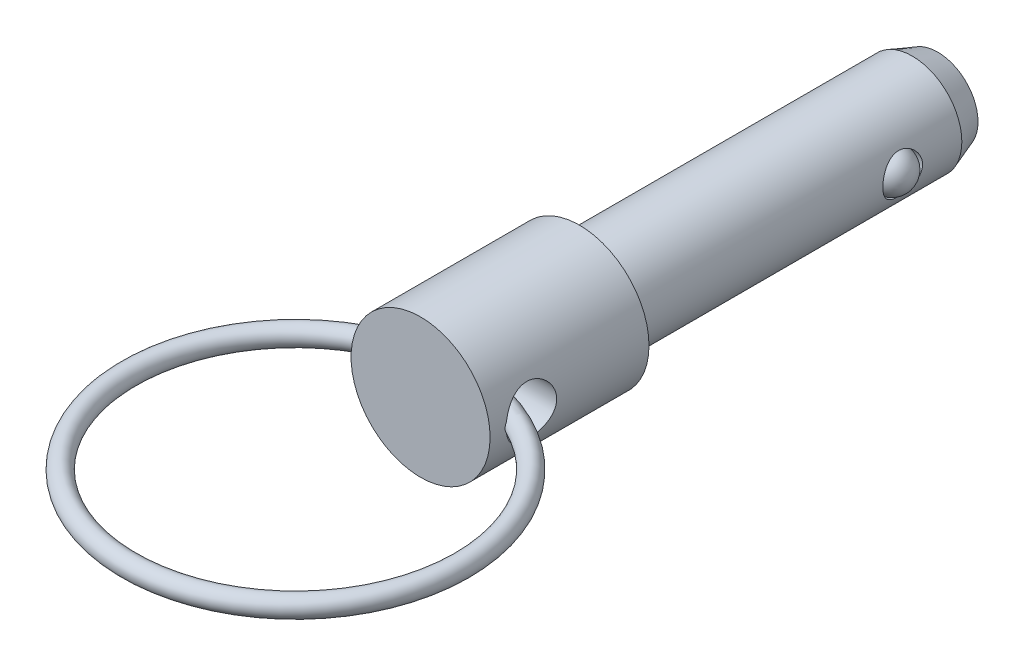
ISO-10303-21;
HEADER;
FILE_DESCRIPTION(('STEP AP214'),'2;1');
FILE_NAME('part.step','',(''),(''),'','','');
FILE_SCHEMA(('AUTOMOTIVE_DESIGN { 1 0 10303 214 1 1 1 1 }'));
ENDSEC;
DATA;
#1=APPLICATION_CONTEXT('core data for automotive mechanical design processes');
#2=APPLICATION_PROTOCOL_DEFINITION('international standard','automotive_design',2000,#1);
#3=PRODUCT_CONTEXT('',#1,'mechanical');
#4=PRODUCT('Part','Part','',(#3));
#5=PRODUCT_RELATED_PRODUCT_CATEGORY('part','',(#4));
#6=PRODUCT_DEFINITION_FORMATION('','',#4);
#7=PRODUCT_DEFINITION_CONTEXT('part definition',#1,'design');
#8=PRODUCT_DEFINITION('design','',#6,#7);
#9=PRODUCT_DEFINITION_SHAPE('','',#8);
#10=(LENGTH_UNIT() NAMED_UNIT(*) SI_UNIT(.MILLI.,.METRE.));
#11=(NAMED_UNIT(*) PLANE_ANGLE_UNIT() SI_UNIT($,.RADIAN.));
#12=(NAMED_UNIT(*) SI_UNIT($,.STERADIAN.) SOLID_ANGLE_UNIT());
#13=UNCERTAINTY_MEASURE_WITH_UNIT(LENGTH_MEASURE(1.E-05),#10,'distance_accuracy_value','');
#14=(GEOMETRIC_REPRESENTATION_CONTEXT(3) GLOBAL_UNCERTAINTY_ASSIGNED_CONTEXT((#13)) GLOBAL_UNIT_ASSIGNED_CONTEXT((#10,
#11,#12)) REPRESENTATION_CONTEXT('',''));
#15=CARTESIAN_POINT('',(0.,0.,0.));
#16=DIRECTION('',(0.,0.,1.));
#17=DIRECTION('',(1.,0.,0.));
#18=AXIS2_PLACEMENT_3D('',#15,#16,#17);
#19=CARTESIAN_POINT('',(7.9375,0.,9.398));
#20=DIRECTION('',(-1.,0.,0.));
#21=DIRECTION('',(0.,0.,-1.));
#22=AXIS2_PLACEMENT_3D('',#19,#20,#21);
#23=CYLINDRICAL_SURFACE('',#22,2.0193);
#24=CARTESIAN_POINT('',(-5.55645,0.413388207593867,11.3745329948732));
#25=CARTESIAN_POINT('',(-5.53323669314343,0.388835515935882,11.3796705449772));
#26=CARTESIAN_POINT('',(-5.51157389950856,0.362641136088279,11.3846690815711));
#27=CARTESIAN_POINT('',(-5.47216390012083,0.307044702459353,11.3940198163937));
#28=CARTESIAN_POINT('',(-5.45444977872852,0.277618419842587,11.3983664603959));
#29=CARTESIAN_POINT('',(-5.42406600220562,0.215851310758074,11.4059720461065));
#30=CARTESIAN_POINT('',(-5.41142802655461,0.183493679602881,11.4092241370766));
#31=CARTESIAN_POINT('',(-5.39235124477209,0.116986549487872,11.4141821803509));
#32=CARTESIAN_POINT('',(-5.38588919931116,0.082844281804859,11.4158939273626));
#33=CARTESIAN_POINT('',(-5.37995615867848,0.0172985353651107,11.4174656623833));
#34=CARTESIAN_POINT('',(-5.37986165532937,-0.0140451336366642,11.4174908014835));
#35=CARTESIAN_POINT('',(-5.38511249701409,-0.0762532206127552,11.4160995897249));
#36=CARTESIAN_POINT('',(-5.39046041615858,-0.10711740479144,11.4146825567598));
#37=CARTESIAN_POINT('',(-5.40574321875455,-0.165640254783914,11.4106965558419));
#38=CARTESIAN_POINT('',(-5.41539031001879,-0.193380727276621,11.408200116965));
#39=CARTESIAN_POINT('',(-5.43862859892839,-0.247073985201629,11.4023097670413));
#40=CARTESIAN_POINT('',(-5.45222392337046,-0.273024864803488,11.398914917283));
#41=CARTESIAN_POINT('',(-5.48024922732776,-0.318737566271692,11.3920973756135));
#42=CARTESIAN_POINT('',(-5.49418727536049,-0.338820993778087,11.3887682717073));
#43=CARTESIAN_POINT('',(-5.52397071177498,-0.377330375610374,11.3818282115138));
#44=CARTESIAN_POINT('',(-5.53980753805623,-0.395763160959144,11.378218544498));
#45=CARTESIAN_POINT('',(-5.55645,-0.413388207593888,11.3745329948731));
#46=B_SPLINE_CURVE_WITH_KNOTS('',3,(#24,#25,#26,#27,#28,#29,#30,#31,#32,#33,#34,#35,#36,#37,#38,
#39,#40,#41,#42,#43,#44,#45),.UNSPECIFIED.,.F.,.F.,(4,2,2,2,2,2,2,2,2,2,4),(0.,
0.102621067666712,0.206072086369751,0.310159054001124,0.413852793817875,0.507376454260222,
0.600944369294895,0.689017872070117,0.77718376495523,0.851068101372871,0.924630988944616),.UNSPECIFIED.);
#47=CARTESIAN_POINT('',(-5.54200209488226,0.397651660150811,11.3777589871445));
#48=VERTEX_POINT('',#47);
#49=CARTESIAN_POINT('',(-5.54200209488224,-0.397651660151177,11.3777589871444));
#50=VERTEX_POINT('',#49);
#51=EDGE_CURVE('E39',#48,#50,#46,.T.);
#52=ORIENTED_EDGE('',*,*,#51,.F.);
#53=CARTESIAN_POINT('',(-5.55625,0.,11.4173));
#54=CARTESIAN_POINT('',(-5.55624527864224,-0.10943212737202,11.4172937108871));
#55=CARTESIAN_POINT('',(-5.55298237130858,-0.218969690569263,11.408361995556));
#56=CARTESIAN_POINT('',(-5.54026368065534,-0.434902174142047,11.372953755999));
#57=CARTESIAN_POINT('',(-5.53079819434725,-0.541291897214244,11.3464497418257));
#58=CARTESIAN_POINT('',(-5.50670156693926,-0.747605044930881,11.2769560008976));
#59=CARTESIAN_POINT('',(-5.49208344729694,-0.847544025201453,11.2340078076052));
#60=CARTESIAN_POINT('',(-5.45915039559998,-1.03875753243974,11.1330083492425));
#61=CARTESIAN_POINT('',(-5.44083572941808,-1.13003268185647,11.0749581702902));
#62=CARTESIAN_POINT('',(-5.4015811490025,-1.30505728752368,10.9429422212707));
#63=CARTESIAN_POINT('',(-5.38056990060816,-1.38841141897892,10.8684736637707));
#64=CARTESIAN_POINT('',(-5.33865236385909,-1.54176439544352,10.7067995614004));
#65=CARTESIAN_POINT('',(-5.31774611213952,-1.61175885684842,10.6195898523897));
#66=CARTESIAN_POINT('',(-5.27759352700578,-1.73882919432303,10.4311528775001));
#67=CARTESIAN_POINT('',(-5.25843183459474,-1.79536185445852,10.3295394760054));
#68=CARTESIAN_POINT('',(-5.22503611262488,-1.89036141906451,10.1174402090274));
#69=CARTESIAN_POINT('',(-5.21080023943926,-1.92883508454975,10.0069576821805));
#70=CARTESIAN_POINT('',(-5.18962447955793,-1.985091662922,9.78477737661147));
#71=CARTESIAN_POINT('',(-5.18242178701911,-2.00362275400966,9.67329490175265));
#72=CARTESIAN_POINT('',(-5.17535625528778,-2.02180769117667,9.44858805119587));
#73=CARTESIAN_POINT('',(-5.17549061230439,-2.02146874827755,9.33536435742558));
#74=CARTESIAN_POINT('',(-5.18285629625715,-2.00249790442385,9.11709454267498));
#75=CARTESIAN_POINT('',(-5.18969215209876,-1.98488533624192,9.01194405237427));
#76=CARTESIAN_POINT('',(-5.20903632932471,-1.93354575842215,8.80620743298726));
#77=CARTESIAN_POINT('',(-5.22154547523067,-1.89981640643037,8.70562196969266));
#78=CARTESIAN_POINT('',(-5.25107746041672,-1.81661001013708,8.50972358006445));
#79=CARTESIAN_POINT('',(-5.26817827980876,-1.76685762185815,8.41453987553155));
#80=CARTESIAN_POINT('',(-5.30493780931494,-1.65321144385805,8.23357336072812));
#81=CARTESIAN_POINT('',(-5.32459724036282,-1.58931366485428,8.14779321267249));
#82=CARTESIAN_POINT('',(-5.36576425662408,-1.44447059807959,7.98240722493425));
#83=CARTESIAN_POINT('',(-5.3873104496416,-1.36270785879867,7.90352531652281));
#84=CARTESIAN_POINT('',(-5.42876622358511,-1.18682967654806,7.76035905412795));
#85=CARTESIAN_POINT('',(-5.44867505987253,-1.09270866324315,7.69608131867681));
#86=CARTESIAN_POINT('',(-5.48497084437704,-0.893001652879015,7.58320896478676));
#87=CARTESIAN_POINT('',(-5.50130295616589,-0.787270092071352,7.53485348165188));
#88=CARTESIAN_POINT('',(-5.52817729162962,-0.568540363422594,7.45692936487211));
#89=CARTESIAN_POINT('',(-5.53873126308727,-0.455557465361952,7.42732259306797));
#90=CARTESIAN_POINT('',(-5.54924569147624,-0.284581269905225,7.39803699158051));
#91=CARTESIAN_POINT('',(-5.5518636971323,-0.227949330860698,7.39079572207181));
#92=CARTESIAN_POINT('',(-5.55536708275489,-0.114221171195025,7.38112558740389));
#93=CARTESIAN_POINT('',(-5.55625246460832,-0.0571249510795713,7.37869671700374));
#94=CARTESIAN_POINT('',(-5.55624527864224,0.109432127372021,7.37870628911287));
#95=CARTESIAN_POINT('',(-5.55298237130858,0.218969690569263,7.38763800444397));
#96=CARTESIAN_POINT('',(-5.54026368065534,0.434902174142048,7.42304624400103));
#97=CARTESIAN_POINT('',(-5.53079819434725,0.541291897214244,7.44955025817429));
#98=CARTESIAN_POINT('',(-5.50670156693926,0.747605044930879,7.51904399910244));
#99=CARTESIAN_POINT('',(-5.49208344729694,0.847544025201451,7.56199219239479));
#100=CARTESIAN_POINT('',(-5.45915039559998,1.03875753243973,7.66299165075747));
#101=CARTESIAN_POINT('',(-5.44083572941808,1.13003268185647,7.72104182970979));
#102=CARTESIAN_POINT('',(-5.4015811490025,1.30505728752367,7.85305777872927));
#103=CARTESIAN_POINT('',(-5.38056990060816,1.38841141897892,7.92752633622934));
#104=CARTESIAN_POINT('',(-5.33865236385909,1.54176439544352,8.08920043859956));
#105=CARTESIAN_POINT('',(-5.31774611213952,1.61175885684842,8.17641014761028));
#106=CARTESIAN_POINT('',(-5.27759352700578,1.73882919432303,8.36484712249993));
#107=CARTESIAN_POINT('',(-5.25843183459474,1.79536185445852,8.46646052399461));
#108=CARTESIAN_POINT('',(-5.22503611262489,1.89036141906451,8.6785597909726));
#109=CARTESIAN_POINT('',(-5.21080023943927,1.92883508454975,8.7890423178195));
#110=CARTESIAN_POINT('',(-5.18962447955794,1.98509166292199,9.01122262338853));
#111=CARTESIAN_POINT('',(-5.18242178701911,2.00362275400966,9.12270509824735));
#112=CARTESIAN_POINT('',(-5.17535625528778,2.02180769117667,9.34741194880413));
#113=CARTESIAN_POINT('',(-5.17549061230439,2.02146874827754,9.46063564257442));
#114=CARTESIAN_POINT('',(-5.18285629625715,2.00249790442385,9.67890545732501));
#115=CARTESIAN_POINT('',(-5.18969215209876,1.98488533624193,9.78405594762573));
#116=CARTESIAN_POINT('',(-5.20903632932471,1.93354575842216,9.98979256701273));
#117=CARTESIAN_POINT('',(-5.22154547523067,1.89981640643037,10.0903780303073));
#118=CARTESIAN_POINT('',(-5.25107746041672,1.81661001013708,10.2862764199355));
#119=CARTESIAN_POINT('',(-5.26817827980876,1.76685762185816,10.3814601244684));
#120=CARTESIAN_POINT('',(-5.30493780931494,1.65321144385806,10.5624266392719));
#121=CARTESIAN_POINT('',(-5.32459724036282,1.58931366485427,10.6482067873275));
#122=CARTESIAN_POINT('',(-5.36576425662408,1.44447059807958,10.8135927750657));
#123=CARTESIAN_POINT('',(-5.3873104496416,1.36270785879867,10.8924746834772));
#124=CARTESIAN_POINT('',(-5.42876622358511,1.18682967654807,11.035640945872));
#125=CARTESIAN_POINT('',(-5.44867505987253,1.09270866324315,11.0999186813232));
#126=CARTESIAN_POINT('',(-5.48497084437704,0.893001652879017,11.2127910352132));
#127=CARTESIAN_POINT('',(-5.50130295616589,0.787270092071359,11.2611465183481));
#128=CARTESIAN_POINT('',(-5.52817729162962,0.568540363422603,11.3390706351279));
#129=CARTESIAN_POINT('',(-5.53873126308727,0.455557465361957,11.368677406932));
#130=CARTESIAN_POINT('',(-5.54924569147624,0.284581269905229,11.3979630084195));
#131=CARTESIAN_POINT('',(-5.5518636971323,0.227949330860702,11.4052042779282));
#132=CARTESIAN_POINT('',(-5.55536708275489,0.114221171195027,11.4148744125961));
#133=CARTESIAN_POINT('',(-5.55625246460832,0.0571249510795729,11.4173032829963));
#134=CARTESIAN_POINT('',(-5.55625,0.,11.4173));
#135=B_SPLINE_CURVE_WITH_KNOTS('',3,(#53,#54,#55,#56,#57,#58,#59,#60,#61,#62,#63,#64,#65,#66,
#67,#68,#69,#70,#71,#72,#73,#74,#75,#76,#77,#78,#79,#80,#81,#82,#83,#84,#85,#86,#87,#88,#89,#90,
#91,#92,#93,#94,#95,#96,#97,#98,#99,#100,#101,#102,#103,#104,#105,#106,#107,#108,#109,#110,#111,
#112,#113,#114,#115,#116,#117,#118,#119,#120,#121,#122,#123,#124,#125,#126,#127,#128,#129,#130,
#131,#132,#133,#134),.UNSPECIFIED.,.T.,.F.,(4,2,2,2,2,2,2,2,2,2,2,2,2,2,2,2,2,2,2,2,2,2,2,2,2,2,
2,2,2,2,2,2,2,2,2,2,2,2,2,2,4),(0.,0.328075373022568,0.656665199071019,0.984430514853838,
1.31217226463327,1.65185430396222,1.99164760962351,2.34343505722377,2.6950906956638,
3.03303658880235,3.37085333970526,3.68986542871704,4.0089238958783,4.33378721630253,
4.65874227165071,5.00406386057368,5.34954163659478,5.69999369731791,6.04973056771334,
6.22099023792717,6.39224972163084,6.72032509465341,7.04891492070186,7.37668023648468,
7.7044219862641,8.04410402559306,8.38389733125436,8.73568477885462,9.08734041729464,
9.42528631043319,9.7631030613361,10.0821151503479,10.4011736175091,10.7260369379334,
11.0509919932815,11.3963135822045,11.7417913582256,12.0922434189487,12.4419802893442,
12.613239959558,12.7844994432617),.UNSPECIFIED.);
#136=EDGE_CURVE('E65',#50,#48,#135,.T.);
#137=ORIENTED_EDGE('',*,*,#136,.F.);
#138=EDGE_LOOP('',(#52,#137));
#139=FACE_BOUND('',#138,.T.);
#140=CARTESIAN_POINT('',(5.55645,-0.413388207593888,11.3745329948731));
#141=CARTESIAN_POINT('',(5.53323669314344,-0.388835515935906,11.3796705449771));
#142=CARTESIAN_POINT('',(5.51157389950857,-0.362641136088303,11.3846690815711));
#143=CARTESIAN_POINT('',(5.47216390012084,-0.307044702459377,11.3940198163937));
#144=CARTESIAN_POINT('',(5.45444977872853,-0.277618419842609,11.3983664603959));
#145=CARTESIAN_POINT('',(5.42406600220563,-0.215851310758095,11.4059720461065));
#146=CARTESIAN_POINT('',(5.41142802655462,-0.183493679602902,11.4092241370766));
#147=CARTESIAN_POINT('',(5.39235124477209,-0.116986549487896,11.4141821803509));
#148=CARTESIAN_POINT('',(5.38588919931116,-0.0828442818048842,11.4158939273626));
#149=CARTESIAN_POINT('',(5.37995615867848,-0.0172985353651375,11.4174656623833));
#150=CARTESIAN_POINT('',(5.37986165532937,0.0140451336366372,11.4174908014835));
#151=CARTESIAN_POINT('',(5.3851124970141,0.0762532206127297,11.4160995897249));
#152=CARTESIAN_POINT('',(5.39046041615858,0.107117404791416,11.4146825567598));
#153=CARTESIAN_POINT('',(5.40574321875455,0.165640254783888,11.4106965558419));
#154=CARTESIAN_POINT('',(5.41539031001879,0.19338072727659,11.408200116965));
#155=CARTESIAN_POINT('',(5.43862859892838,0.247073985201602,11.4023097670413));
#156=CARTESIAN_POINT('',(5.45222392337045,0.273024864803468,11.398914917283));
#157=CARTESIAN_POINT('',(5.48024922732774,0.318737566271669,11.3920973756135));
#158=CARTESIAN_POINT('',(5.49418727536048,0.338820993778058,11.3887682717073));
#159=CARTESIAN_POINT('',(5.52397071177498,0.37733037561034,11.3818282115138));
#160=CARTESIAN_POINT('',(5.53980753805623,0.395763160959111,11.378218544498));
#161=CARTESIAN_POINT('',(5.55645,0.413388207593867,11.3745329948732));
#162=B_SPLINE_CURVE_WITH_KNOTS('',3,(#140,#141,#142,#143,#144,#145,#146,#147,#148,#149,#150,
#151,#152,#153,#154,#155,#156,#157,#158,#159,#160,#161),.UNSPECIFIED.,.F.,.F.,(4,2,2,2,2,2,2,2,
2,2,4),(0.,0.102621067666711,0.206072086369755,0.310159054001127,0.413852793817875,
0.507376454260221,0.600944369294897,0.689017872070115,0.777183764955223,0.851068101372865,
0.924630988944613),.UNSPECIFIED.);
#163=CARTESIAN_POINT('',(5.54200209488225,-0.397651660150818,11.3777589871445));
#164=VERTEX_POINT('',#163);
#165=CARTESIAN_POINT('',(5.54200209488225,0.397651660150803,11.3777589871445));
#166=VERTEX_POINT('',#165);
#167=EDGE_CURVE('E32',#164,#166,#162,.T.);
#168=ORIENTED_EDGE('',*,*,#167,.F.);
#169=CARTESIAN_POINT('',(5.55625,0.,7.3787));
#170=CARTESIAN_POINT('',(5.55624527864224,-0.109432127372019,7.37870628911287));
#171=CARTESIAN_POINT('',(5.55298237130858,-0.218969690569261,7.38763800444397));
#172=CARTESIAN_POINT('',(5.54026368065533,-0.434902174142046,7.42304624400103));
#173=CARTESIAN_POINT('',(5.53079819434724,-0.541291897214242,7.44955025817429));
#174=CARTESIAN_POINT('',(5.50670156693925,-0.747605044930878,7.51904399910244));
#175=CARTESIAN_POINT('',(5.49208344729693,-0.84754402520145,7.56199219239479));
#176=CARTESIAN_POINT('',(5.45915039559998,-1.03875753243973,7.66299165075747));
#177=CARTESIAN_POINT('',(5.44083572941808,-1.13003268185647,7.72104182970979));
#178=CARTESIAN_POINT('',(5.4015811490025,-1.30505728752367,7.85305777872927));
#179=CARTESIAN_POINT('',(5.38056990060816,-1.38841141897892,7.92752633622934));
#180=CARTESIAN_POINT('',(5.33865236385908,-1.54176439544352,8.08920043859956));
#181=CARTESIAN_POINT('',(5.31774611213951,-1.61175885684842,8.17641014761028));
#182=CARTESIAN_POINT('',(5.27759352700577,-1.73882919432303,8.36484712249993));
#183=CARTESIAN_POINT('',(5.25843183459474,-1.79536185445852,8.46646052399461));
#184=CARTESIAN_POINT('',(5.22503611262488,-1.89036141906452,8.67855979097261));
#185=CARTESIAN_POINT('',(5.21080023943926,-1.92883508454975,8.7890423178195));
#186=CARTESIAN_POINT('',(5.18962447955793,-1.985091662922,9.01122262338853));
#187=CARTESIAN_POINT('',(5.18242178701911,-2.00362275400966,9.12270509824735));
#188=CARTESIAN_POINT('',(5.17535625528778,-2.02180769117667,9.34741194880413));
#189=CARTESIAN_POINT('',(5.17549061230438,-2.02146874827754,9.46063564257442));
#190=CARTESIAN_POINT('',(5.18285629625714,-2.00249790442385,9.67890545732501));
#191=CARTESIAN_POINT('',(5.18969215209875,-1.98488533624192,9.78405594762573));
#192=CARTESIAN_POINT('',(5.20903632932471,-1.93354575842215,9.98979256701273));
#193=CARTESIAN_POINT('',(5.22154547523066,-1.89981640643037,10.0903780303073));
#194=CARTESIAN_POINT('',(5.25107746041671,-1.81661001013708,10.2862764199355));
#195=CARTESIAN_POINT('',(5.26817827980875,-1.76685762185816,10.3814601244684));
#196=CARTESIAN_POINT('',(5.30493780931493,-1.65321144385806,10.5624266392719));
#197=CARTESIAN_POINT('',(5.32459724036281,-1.58931366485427,10.6482067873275));
#198=CARTESIAN_POINT('',(5.36576425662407,-1.44447059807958,10.8135927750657));
#199=CARTESIAN_POINT('',(5.3873104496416,-1.36270785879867,10.8924746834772));
#200=CARTESIAN_POINT('',(5.42876622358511,-1.18682967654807,11.035640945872));
#201=CARTESIAN_POINT('',(5.44867505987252,-1.09270866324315,11.0999186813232));
#202=CARTESIAN_POINT('',(5.48497084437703,-0.893001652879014,11.2127910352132));
#203=CARTESIAN_POINT('',(5.50130295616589,-0.787270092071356,11.2611465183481));
#204=CARTESIAN_POINT('',(5.52817729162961,-0.5685403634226,11.3390706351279));
#205=CARTESIAN_POINT('',(5.53873126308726,-0.455557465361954,11.368677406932));
#206=CARTESIAN_POINT('',(5.54924569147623,-0.284581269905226,11.3979630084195));
#207=CARTESIAN_POINT('',(5.5518636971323,-0.227949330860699,11.4052042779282));
#208=CARTESIAN_POINT('',(5.55536708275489,-0.114221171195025,11.4148744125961));
#209=CARTESIAN_POINT('',(5.55625246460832,-0.0571249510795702,11.4173032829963));
#210=CARTESIAN_POINT('',(5.55624527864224,0.109432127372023,11.4172937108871));
#211=CARTESIAN_POINT('',(5.55298237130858,0.218969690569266,11.408361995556));
#212=CARTESIAN_POINT('',(5.54026368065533,0.43490217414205,11.372953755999));
#213=CARTESIAN_POINT('',(5.53079819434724,0.541291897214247,11.3464497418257));
#214=CARTESIAN_POINT('',(5.50670156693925,0.747605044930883,11.2769560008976));
#215=CARTESIAN_POINT('',(5.49208344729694,0.847544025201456,11.2340078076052));
#216=CARTESIAN_POINT('',(5.45915039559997,1.03875753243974,11.1330083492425));
#217=CARTESIAN_POINT('',(5.44083572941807,1.13003268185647,11.0749581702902));
#218=CARTESIAN_POINT('',(5.40158114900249,1.30505728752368,10.9429422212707));
#219=CARTESIAN_POINT('',(5.38056990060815,1.38841141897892,10.8684736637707));
#220=CARTESIAN_POINT('',(5.33865236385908,1.54176439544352,10.7067995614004));
#221=CARTESIAN_POINT('',(5.31774611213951,1.61175885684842,10.6195898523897));
#222=CARTESIAN_POINT('',(5.27759352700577,1.73882919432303,10.4311528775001));
#223=CARTESIAN_POINT('',(5.25843183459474,1.79536185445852,10.3295394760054));
#224=CARTESIAN_POINT('',(5.22503611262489,1.89036141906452,10.1174402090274));
#225=CARTESIAN_POINT('',(5.21080023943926,1.92883508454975,10.0069576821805));
#226=CARTESIAN_POINT('',(5.18962447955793,1.985091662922,9.78477737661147));
#227=CARTESIAN_POINT('',(5.18242178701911,2.00362275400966,9.67329490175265));
#228=CARTESIAN_POINT('',(5.17535625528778,2.02180769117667,9.44858805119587));
#229=CARTESIAN_POINT('',(5.17549061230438,2.02146874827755,9.33536435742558));
#230=CARTESIAN_POINT('',(5.18285629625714,2.00249790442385,9.11709454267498));
#231=CARTESIAN_POINT('',(5.18969215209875,1.98488533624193,9.01194405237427));
#232=CARTESIAN_POINT('',(5.20903632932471,1.93354575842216,8.80620743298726));
#233=CARTESIAN_POINT('',(5.22154547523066,1.89981640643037,8.70562196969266));
#234=CARTESIAN_POINT('',(5.25107746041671,1.81661001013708,8.50972358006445));
#235=CARTESIAN_POINT('',(5.26817827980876,1.76685762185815,8.41453987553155));
#236=CARTESIAN_POINT('',(5.30493780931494,1.65321144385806,8.23357336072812));
#237=CARTESIAN_POINT('',(5.32459724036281,1.58931366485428,8.14779321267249));
#238=CARTESIAN_POINT('',(5.36576425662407,1.44447059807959,7.98240722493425));
#239=CARTESIAN_POINT('',(5.3873104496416,1.36270785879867,7.90352531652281));
#240=CARTESIAN_POINT('',(5.42876622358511,1.18682967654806,7.76035905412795));
#241=CARTESIAN_POINT('',(5.44867505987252,1.09270866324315,7.69608131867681));
#242=CARTESIAN_POINT('',(5.48497084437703,0.893001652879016,7.58320896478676));
#243=CARTESIAN_POINT('',(5.50130295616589,0.787270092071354,7.53485348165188));
#244=CARTESIAN_POINT('',(5.52817729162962,0.568540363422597,7.45692936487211));
#245=CARTESIAN_POINT('',(5.53873126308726,0.455557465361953,7.42732259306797));
#246=CARTESIAN_POINT('',(5.54924569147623,0.284581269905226,7.39803699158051));
#247=CARTESIAN_POINT('',(5.5518636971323,0.227949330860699,7.39079572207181));
#248=CARTESIAN_POINT('',(5.55536708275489,0.114221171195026,7.38112558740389));
#249=CARTESIAN_POINT('',(5.55625246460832,0.0571249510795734,7.37869671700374));
#250=CARTESIAN_POINT('',(5.55625,0.,7.3787));
#251=B_SPLINE_CURVE_WITH_KNOTS('',3,(#169,#170,#171,#172,#173,#174,#175,#176,#177,#178,#179,
#180,#181,#182,#183,#184,#185,#186,#187,#188,#189,#190,#191,#192,#193,#194,#195,#196,#197,#198,
#199,#200,#201,#202,#203,#204,#205,#206,#207,#208,#209,#210,#211,#212,#213,#214,#215,#216,#217,
#218,#219,#220,#221,#222,#223,#224,#225,#226,#227,#228,#229,#230,#231,#232,#233,#234,#235,#236,
#237,#238,#239,#240,#241,#242,#243,#244,#245,#246,#247,#248,#249,#250),.UNSPECIFIED.,.T.,.F.,(4,
2,2,2,2,2,2,2,2,2,2,2,2,2,2,2,2,2,2,2,2,2,2,2,2,2,2,2,2,2,2,2,2,2,2,2,2,2,2,2,4),(0.,
0.328075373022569,0.65666519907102,0.984430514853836,1.31217226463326,1.65185430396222,
1.99164760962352,2.34343505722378,2.6950906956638,3.03303658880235,3.37085333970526,
3.68986542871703,4.00892389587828,4.33378721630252,4.65874227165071,5.00406386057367,
5.34954163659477,5.6999936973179,6.04973056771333,6.22099023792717,6.39224972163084,
6.72032509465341,7.04891492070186,7.37668023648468,7.7044219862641,8.04410402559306,
8.38389733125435,8.73568477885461,9.08734041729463,9.42528631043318,9.7631030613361,
10.0821151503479,10.4011736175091,10.7260369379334,11.0509919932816,11.3963135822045,
11.7417913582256,12.0922434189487,12.4419802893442,12.613239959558,12.7844994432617),.UNSPECIFIED.);
#252=EDGE_CURVE('E61',#166,#164,#251,.T.);
#253=ORIENTED_EDGE('',*,*,#252,.F.);
#254=EDGE_LOOP('',(#168,#253));
#255=FACE_BOUND('',#254,.T.);
#256=ADVANCED_FACE('F14',(#139,#255),#23,.F.);
#257=CARTESIAN_POINT('',(0.,0.,-28.63596));
#258=DIRECTION('',(0.,0.,-1.));
#259=DIRECTION('',(1.,0.,0.));
#260=AXIS2_PLACEMENT_3D('',#257,#258,#259);
#261=CYLINDRICAL_SURFACE('',#260,5.55625);
#262=ORIENTED_EDGE('',*,*,#252,.T.);
#263=CARTESIAN_POINT('',(5.55009347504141,-0.261488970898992,9.7860840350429));
#264=CARTESIAN_POINT('',(5.54812529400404,-0.303251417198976,9.80096224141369));
#265=CARTESIAN_POINT('',(5.5457404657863,-0.34375863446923,9.8194200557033));
#266=CARTESIAN_POINT('',(5.54040847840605,-0.421066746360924,9.86292845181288));
#267=CARTESIAN_POINT('',(5.5374605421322,-0.45786241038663,9.88798816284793));
#268=CARTESIAN_POINT('',(5.53134134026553,-0.526658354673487,9.94386457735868));
#269=CARTESIAN_POINT('',(5.52817046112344,-0.558666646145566,9.97467146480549));
#270=CARTESIAN_POINT('',(5.52194469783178,-0.617178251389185,10.0411137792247));
#271=CARTESIAN_POINT('',(5.51888978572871,-0.643682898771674,10.0767480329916));
#272=CARTESIAN_POINT('',(5.51313628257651,-0.69125437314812,10.1527268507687));
#273=CARTESIAN_POINT('',(5.51044827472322,-0.71217180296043,10.1931655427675));
#274=CARTESIAN_POINT('',(5.50578097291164,-0.747399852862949,10.2768577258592));
#275=CARTESIAN_POINT('',(5.50380188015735,-0.761708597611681,10.3201120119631));
#276=CARTESIAN_POINT('',(5.50062483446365,-0.784334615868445,10.4110491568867));
#277=CARTESIAN_POINT('',(5.4994831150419,-0.792223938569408,10.4588401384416));
#278=CARTESIAN_POINT('',(5.49826873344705,-0.800607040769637,10.5550754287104));
#279=CARTESIAN_POINT('',(5.49819646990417,-0.801098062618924,10.6035199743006));
#280=CARTESIAN_POINT('',(5.49912806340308,-0.79468062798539,10.7039443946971));
#281=CARTESIAN_POINT('',(5.50022168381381,-0.787154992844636,10.7558841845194));
#282=CARTESIAN_POINT('',(5.50347103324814,-0.764103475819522,10.8579332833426));
#283=CARTESIAN_POINT('',(5.50562725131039,-0.748573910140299,10.9080417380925));
#284=CARTESIAN_POINT('',(5.51091051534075,-0.708667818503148,11.0082212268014));
#285=CARTESIAN_POINT('',(5.51408971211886,-0.683800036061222,11.0580951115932));
#286=CARTESIAN_POINT('',(5.52096808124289,-0.625839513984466,11.1528267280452));
#287=CARTESIAN_POINT('',(5.52466742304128,-0.592744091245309,11.1976828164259));
#288=CARTESIAN_POINT('',(5.53199718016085,-0.519831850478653,11.2794067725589));
#289=CARTESIAN_POINT('',(5.53562669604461,-0.48022472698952,11.3164602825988));
#290=CARTESIAN_POINT('',(5.54239660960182,-0.394450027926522,11.3820559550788));
#291=CARTESIAN_POINT('',(5.54553772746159,-0.348292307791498,11.4106107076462));
#292=CARTESIAN_POINT('',(5.55042537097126,-0.257766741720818,11.4537693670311));
#293=CARTESIAN_POINT('',(5.55230678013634,-0.214079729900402,11.4697807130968));
#294=CARTESIAN_POINT('',(5.55503790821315,-0.124373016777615,11.4927832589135));
#295=CARTESIAN_POINT('',(5.55588906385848,-0.07835665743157,11.4997870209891));
#296=CARTESIAN_POINT('',(5.55638432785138,0.00705853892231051,11.5038718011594));
#297=CARTESIAN_POINT('',(5.55619261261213,0.0463971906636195,11.5023023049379));
#298=CARTESIAN_POINT('',(5.55499790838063,0.124194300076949,11.4923961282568));
#299=CARTESIAN_POINT('',(5.5539950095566,0.162652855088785,11.4840601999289));
#300=CARTESIAN_POINT('',(5.55133569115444,0.236455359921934,11.4614747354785));
#301=CARTESIAN_POINT('',(5.54970019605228,0.271858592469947,11.4474138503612));
#302=CARTESIAN_POINT('',(5.54593788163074,0.340082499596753,11.414086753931));
#303=CARTESIAN_POINT('',(5.54381093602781,0.372902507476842,11.3948192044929));
#304=CARTESIAN_POINT('',(5.53902830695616,0.43847905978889,11.3497412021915));
#305=CARTESIAN_POINT('',(5.53634134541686,0.470920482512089,11.3234773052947));
#306=CARTESIAN_POINT('',(5.5308403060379,0.53164948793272,11.2665410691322));
#307=CARTESIAN_POINT('',(5.52802616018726,0.559934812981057,11.2358663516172));
#308=CARTESIAN_POINT('',(5.52207389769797,0.616058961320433,11.1660010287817));
#309=CARTESIAN_POINT('',(5.51895184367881,0.643171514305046,11.1262251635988));
#310=CARTESIAN_POINT('',(5.5131400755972,0.691221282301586,11.0430715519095));
#311=CARTESIAN_POINT('',(5.51045062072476,0.712154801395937,10.9996916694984));
#312=CARTESIAN_POINT('',(5.50546631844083,0.749774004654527,10.9047684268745));
#313=CARTESIAN_POINT('',(5.5032620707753,0.765608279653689,10.8528805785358));
#314=CARTESIAN_POINT('',(5.49999925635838,0.788707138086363,10.7471802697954));
#315=CARTESIAN_POINT('',(5.49894104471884,0.795969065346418,10.693367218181));
#316=CARTESIAN_POINT('',(5.49812737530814,0.801573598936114,10.5836973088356));
#317=CARTESIAN_POINT('',(5.49841008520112,0.799654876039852,10.5278260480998));
#318=CARTESIAN_POINT('',(5.50039129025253,0.785912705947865,10.4173293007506));
#319=CARTESIAN_POINT('',(5.50208922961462,0.774093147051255,10.3627033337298));
#320=CARTESIAN_POINT('',(5.50657222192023,0.74150273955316,10.2600057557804));
#321=CARTESIAN_POINT('',(5.50928213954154,0.721341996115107,10.2117380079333));
#322=CARTESIAN_POINT('',(5.51545799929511,0.672487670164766,10.1197820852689));
#323=CARTESIAN_POINT('',(5.51892350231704,0.64379904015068,10.0760912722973));
#324=CARTESIAN_POINT('',(5.5258260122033,0.581424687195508,9.99852087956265));
#325=CARTESIAN_POINT('',(5.52923968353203,0.548383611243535,9.96412004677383));
#326=CARTESIAN_POINT('',(5.53588272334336,0.47666389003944,9.90178589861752));
#327=CARTESIAN_POINT('',(5.53911216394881,0.437987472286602,9.87385003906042));
#328=CARTESIAN_POINT('',(5.54480401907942,0.358545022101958,9.82683552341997));
#329=CARTESIAN_POINT('',(5.54729992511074,0.318028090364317,9.80733901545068));
#330=CARTESIAN_POINT('',(5.55147034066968,0.234199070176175,9.7755782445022));
#331=CARTESIAN_POINT('',(5.55314476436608,0.190886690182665,9.76331473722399));
#332=CARTESIAN_POINT('',(5.55544526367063,0.103875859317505,9.74662090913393));
#333=CARTESIAN_POINT('',(5.55609634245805,0.0602137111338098,9.74200361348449));
#334=CARTESIAN_POINT('',(5.55635470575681,-0.0272293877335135,9.74015977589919));
#335=CARTESIAN_POINT('',(5.5559634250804,-0.0710100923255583,9.74292307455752));
#336=CARTESIAN_POINT('',(5.55456091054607,-0.139289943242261,9.75303365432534));
#337=CARTESIAN_POINT('',(5.55387840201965,-0.164176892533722,9.75797314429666));
#338=CARTESIAN_POINT('',(5.55220711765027,-0.213342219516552,9.77024669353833));
#339=CARTESIAN_POINT('',(5.55121834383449,-0.237620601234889,9.77758073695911));
#340=CARTESIAN_POINT('',(5.55009347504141,-0.261488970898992,9.7860840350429));
#341=B_SPLINE_CURVE_WITH_KNOTS('',3,(#263,#264,#265,#266,#267,#268,#269,#270,#271,#272,#273,
#274,#275,#276,#277,#278,#279,#280,#281,#282,#283,#284,#285,#286,#287,#288,#289,#290,#291,#292,
#293,#294,#295,#296,#297,#298,#299,#300,#301,#302,#303,#304,#305,#306,#307,#308,#309,#310,#311,
#312,#313,#314,#315,#316,#317,#318,#319,#320,#321,#322,#323,#324,#325,#326,#327,#328,#329,#330,
#331,#332,#333,#334,#335,#336,#337,#338,#339,#340),.UNSPECIFIED.,.T.,.F.,(4,2,2,2,2,2,2,2,2,2,2,
2,2,2,2,2,2,2,2,2,2,2,2,2,2,2,2,2,2,2,2,2,2,2,2,2,2,2,4),(0.,0.133035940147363,0.26625681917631,
0.399252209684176,0.532215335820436,0.668441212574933,0.804705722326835,0.949444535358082,
1.09423729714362,1.25104087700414,1.4079166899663,1.57457416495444,1.7412860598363,
1.90341673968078,2.06530602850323,2.20414603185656,2.34279219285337,2.46030997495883,
2.57781469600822,2.69172579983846,2.80566620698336,2.93066170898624,3.05572486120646,
3.19986521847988,3.34409161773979,3.5062449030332,3.66844841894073,3.83529611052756,
4.00207830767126,4.15836501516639,4.31456113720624,4.45728171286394,4.59994602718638,
4.73438372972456,4.8688354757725,4.99994808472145,5.13088030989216,5.20691445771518,
5.28294810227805),.UNSPECIFIED.);
#342=EDGE_CURVE('E26',#164,#166,#341,.T.);
#343=ORIENTED_EDGE('',*,*,#342,.T.);
#344=EDGE_LOOP('',(#262,#343));
#345=FACE_BOUND('',#344,.T.);
#346=CARTESIAN_POINT('',(0.,0.,-8.26977375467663E-11));
#347=DIRECTION('',(0.,0.,-1.));
#348=DIRECTION('',(1.,0.,0.));
#349=AXIS2_PLACEMENT_3D('',#346,#347,#348);
#350=CIRCLE('',#349,5.55625000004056);
#351=CARTESIAN_POINT('',(5.55625000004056,0.,-8.2697982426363E-11));
#352=VERTEX_POINT('',#351);
#353=EDGE_CURVE('E70',#352,#352,#350,.T.);
#354=ORIENTED_EDGE('',*,*,#353,.F.);
#355=EDGE_LOOP('',(#354));
#356=FACE_BOUND('',#355,.T.);
#357=CARTESIAN_POINT('',(0.,0.,12.7000000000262));
#358=DIRECTION('',(0.,0.,-1.));
#359=DIRECTION('',(1.,0.,0.));
#360=AXIS2_PLACEMENT_3D('',#357,#358,#359);
#361=CIRCLE('',#360,5.55625000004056);
#362=CARTESIAN_POINT('',(5.55625000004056,0.,12.7000000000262));
#363=VERTEX_POINT('',#362);
#364=EDGE_CURVE('E280',#363,#363,#361,.T.);
#365=ORIENTED_EDGE('',*,*,#364,.T.);
#366=EDGE_LOOP('',(#365));
#367=FACE_BOUND('',#366,.T.);
#368=ORIENTED_EDGE('',*,*,#136,.T.);
#369=CARTESIAN_POINT('',(-5.55009347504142,-0.261488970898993,9.7860840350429));
#370=CARTESIAN_POINT('',(-5.55201952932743,-0.220600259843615,9.77152029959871));
#371=CARTESIAN_POINT('',(-5.55354800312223,-0.178464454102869,9.76037150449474));
#372=CARTESIAN_POINT('',(-5.5556384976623,-0.0928868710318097,9.74524129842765));
#373=CARTESIAN_POINT('',(-5.55620009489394,-0.0494445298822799,9.74126302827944));
#374=CARTESIAN_POINT('',(-5.55629347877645,0.037493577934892,9.74059719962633));
#375=CARTESIAN_POINT('',(-5.55582538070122,0.0809893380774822,9.74390882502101));
#376=CARTESIAN_POINT('',(-5.55391173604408,0.16679574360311,9.75772411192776));
#377=CARTESIAN_POINT('',(-5.5524662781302,0.2091064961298,9.76822712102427));
#378=CARTESIAN_POINT('',(-5.54875885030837,0.291350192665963,9.79611251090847));
#379=CARTESIAN_POINT('',(-5.54649699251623,0.331283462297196,9.81349394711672));
#380=CARTESIAN_POINT('',(-5.54140563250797,0.407683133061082,9.85461863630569));
#381=CARTESIAN_POINT('',(-5.53857612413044,0.44414949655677,9.87836195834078));
#382=CARTESIAN_POINT('',(-5.53262152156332,0.513054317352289,9.93180289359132));
#383=CARTESIAN_POINT('',(-5.52949345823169,0.545442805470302,9.96156453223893));
#384=CARTESIAN_POINT('',(-5.52330278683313,0.60492731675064,10.0259730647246));
#385=CARTESIAN_POINT('',(-5.52024018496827,0.632022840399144,10.0606204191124));
#386=CARTESIAN_POINT('',(-5.51440051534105,0.681126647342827,10.1349305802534));
#387=CARTESIAN_POINT('',(-5.51163525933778,0.702950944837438,10.1747156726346));
#388=CARTESIAN_POINT('',(-5.50677513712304,0.74006277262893,10.2572565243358));
#389=CARTESIAN_POINT('',(-5.50468043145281,0.755348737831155,10.3000129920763));
#390=CARTESIAN_POINT('',(-5.50124315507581,0.780002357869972,10.3899815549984));
#391=CARTESIAN_POINT('',(-5.49995301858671,0.788961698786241,10.4373072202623));
#392=CARTESIAN_POINT('',(-5.498425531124,0.799536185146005,10.532783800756));
#393=CARTESIAN_POINT('',(-5.49818856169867,0.80114866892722,10.5809350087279));
#394=CARTESIAN_POINT('',(-5.49877665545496,0.797104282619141,10.6808979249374));
#395=CARTESIAN_POINT('',(-5.49969077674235,0.790837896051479,10.732684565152));
#396=CARTESIAN_POINT('',(-5.502598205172,0.770345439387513,10.8346351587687));
#397=CARTESIAN_POINT('',(-5.50459199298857,0.756115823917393,10.8847983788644));
#398=CARTESIAN_POINT('',(-5.50958513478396,0.718862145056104,10.9855133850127));
#399=CARTESIAN_POINT('',(-5.51264228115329,0.695318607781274,11.0358713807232));
#400=CARTESIAN_POINT('',(-5.51933971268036,0.639982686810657,11.131851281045));
#401=CARTESIAN_POINT('',(-5.5229802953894,0.608186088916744,11.1774707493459));
#402=CARTESIAN_POINT('',(-5.53030695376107,0.537456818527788,11.2614236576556));
#403=CARTESIAN_POINT('',(-5.53399100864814,0.498663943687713,11.2998741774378));
#404=CARTESIAN_POINT('',(-5.54094301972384,0.414294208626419,11.3684444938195));
#405=CARTESIAN_POINT('',(-5.54421186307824,0.368732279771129,11.398582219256));
#406=CARTESIAN_POINT('',(-5.54902610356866,0.285409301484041,11.4415518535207));
#407=CARTESIAN_POINT('',(-5.55079831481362,0.248931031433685,11.4568629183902));
#408=CARTESIAN_POINT('',(-5.55365405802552,0.173909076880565,11.4812007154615));
#409=CARTESIAN_POINT('',(-5.55473812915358,0.135367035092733,11.4902323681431));
#410=CARTESIAN_POINT('',(-5.55609389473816,0.057163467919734,11.5014913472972));
#411=CARTESIAN_POINT('',(-5.55636320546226,0.0174989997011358,11.5036987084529));
#412=CARTESIAN_POINT('',(-5.55604928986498,-0.0615987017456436,11.5011080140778));
#413=CARTESIAN_POINT('',(-5.55546601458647,-0.10103192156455,11.4963095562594));
#414=CARTESIAN_POINT('',(-5.55356355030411,-0.176675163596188,11.4803936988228));
#415=CARTESIAN_POINT('',(-5.55227928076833,-0.212950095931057,11.4695756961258));
#416=CARTESIAN_POINT('',(-5.54913333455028,-0.283330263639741,11.4424161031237));
#417=CARTESIAN_POINT('',(-5.54727154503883,-0.317435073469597,11.4260734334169));
#418=CARTESIAN_POINT('',(-5.54300097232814,-0.38507250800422,11.3872975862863));
#419=CARTESIAN_POINT('',(-5.54056357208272,-0.418407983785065,11.3645254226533));
#420=CARTESIAN_POINT('',(-5.53544762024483,-0.481387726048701,11.3143838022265));
#421=CARTESIAN_POINT('',(-5.53276895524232,-0.511030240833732,11.2870121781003));
#422=CARTESIAN_POINT('',(-5.52699292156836,-0.570330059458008,11.2242365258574));
#423=CARTESIAN_POINT('',(-5.52389129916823,-0.599362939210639,11.1882432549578));
#424=CARTESIAN_POINT('',(-5.51794192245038,-0.651866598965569,11.1123875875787));
#425=CARTESIAN_POINT('',(-5.51509432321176,-0.675333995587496,11.0725228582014));
#426=CARTESIAN_POINT('',(-5.50953849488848,-0.719347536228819,10.9840543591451));
#427=CARTESIAN_POINT('',(-5.50690598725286,-0.739020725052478,10.9350095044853));
#428=CARTESIAN_POINT('',(-5.50259788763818,-0.770442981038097,10.8343900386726));
#429=CARTESIAN_POINT('',(-5.50092272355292,-0.782188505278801,10.782814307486));
#430=CARTESIAN_POINT('',(-5.49868146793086,-0.797800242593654,10.6753545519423));
#431=CARTESIAN_POINT('',(-5.49818587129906,-0.801166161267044,10.6193948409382));
#432=CARTESIAN_POINT('',(-5.49862892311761,-0.798121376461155,10.5077343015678));
#433=CARTESIAN_POINT('',(-5.49956724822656,-0.791712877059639,10.452033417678));
#434=CARTESIAN_POINT('',(-5.50274081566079,-0.769336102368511,10.3451160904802));
#435=CARTESIAN_POINT('',(-5.50491833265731,-0.753792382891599,10.2938098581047));
#436=CARTESIAN_POINT('',(-5.51027934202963,-0.713544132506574,10.1949693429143));
#437=CARTESIAN_POINT('',(-5.51346234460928,-0.688844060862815,10.1474332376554));
#438=CARTESIAN_POINT('',(-5.52010275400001,-0.633315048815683,10.0619154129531));
#439=CARTESIAN_POINT('',(-5.52351228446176,-0.603205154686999,10.0234624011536));
#440=CARTESIAN_POINT('',(-5.53038590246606,-0.536527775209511,9.95266893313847));
#441=CARTESIAN_POINT('',(-5.53384993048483,-0.499966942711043,9.92032224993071));
#442=CARTESIAN_POINT('',(-5.53964550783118,-0.430319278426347,9.86936528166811));
#443=CARTESIAN_POINT('',(-5.54205683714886,-0.398291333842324,9.84930122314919));
#444=CARTESIAN_POINT('',(-5.54644342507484,-0.331652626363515,9.81399262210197));
#445=CARTESIAN_POINT('',(-5.54841874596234,-0.297042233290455,9.79874739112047));
#446=CARTESIAN_POINT('',(-5.55009347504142,-0.261488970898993,9.7860840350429));
#447=B_SPLINE_CURVE_WITH_KNOTS('',3,(#369,#370,#371,#372,#373,#374,#375,#376,#377,#378,#379,
#380,#381,#382,#383,#384,#385,#386,#387,#388,#389,#390,#391,#392,#393,#394,#395,#396,#397,#398,
#399,#400,#401,#402,#403,#404,#405,#406,#407,#408,#409,#410,#411,#412,#413,#414,#415,#416,#417,
#418,#419,#420,#421,#422,#423,#424,#425,#426,#427,#428,#429,#430,#431,#432,#433,#434,#435,#436,
#437,#438,#439,#440,#441,#442,#443,#444,#445,#446),.UNSPECIFIED.,.T.,.F.,(4,2,2,2,2,2,2,2,2,2,2,
2,2,2,2,2,2,2,2,2,2,2,2,2,2,2,2,2,2,2,2,2,2,2,2,2,2,2,4),(0.,0.130208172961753,
0.260473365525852,0.390723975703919,0.520962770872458,0.651183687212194,0.781406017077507,
0.913094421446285,1.04479524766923,1.18058351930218,1.31640427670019,1.46034248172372,
1.60433282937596,1.76017982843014,1.91609626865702,2.08232629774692,2.24864137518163,
2.4119417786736,2.57488717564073,2.69318920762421,2.81139843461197,2.9299531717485,
3.04851471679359,3.16164747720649,3.27480235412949,3.39566347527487,3.51658170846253,
3.65508000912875,3.79366229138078,3.95170470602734,4.10981770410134,4.27716593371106,
4.44447643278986,4.60456550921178,4.76457672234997,4.91068415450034,5.05664177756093,
5.16987565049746,5.283093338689),.UNSPECIFIED.);
#448=EDGE_CURVE('E9',#48,#50,#447,.T.);
#449=ORIENTED_EDGE('',*,*,#448,.T.);
#450=EDGE_LOOP('',(#368,#449));
#451=FACE_BOUND('',#450,.T.);
#452=ADVANCED_FACE('F63',(#345,#356,#367,#451),#261,.T.);
#453=CARTESIAN_POINT('',(0.,-5.30225,12.7));
#454=DIRECTION('',(0.,0.,1.));
#455=DIRECTION('',(-1.,0.,0.));
#456=AXIS2_PLACEMENT_3D('',#453,#454,#455);
#457=PLANE('',#456);
#458=ORIENTED_EDGE('',*,*,#364,.F.);
#459=EDGE_LOOP('',(#458));
#460=FACE_BOUND('',#459,.T.);
#461=ADVANCED_FACE('F85',(#460),#457,.T.);
#462=CARTESIAN_POINT('',(0.,-3.95605,0.));
#463=DIRECTION('',(0.,0.,-1.));
#464=DIRECTION('',(1.,0.,0.));
#465=AXIS2_PLACEMENT_3D('',#462,#463,#464);
#466=PLANE('',#465);
#467=ORIENTED_EDGE('',*,*,#353,.T.);
#468=EDGE_LOOP('',(#467));
#469=FACE_BOUND('',#468,.T.);
#470=CARTESIAN_POINT('',(0.,0.,0.));
#471=DIRECTION('',(0.,0.,-1.));
#472=DIRECTION('',(-1.,0.,0.));
#473=AXIS2_PLACEMENT_3D('',#470,#471,#472);
#474=CIRCLE('',#473,3.95605);
#475=CARTESIAN_POINT('',(-3.95605,0.,0.));
#476=VERTEX_POINT('',#475);
#477=EDGE_CURVE('E59',#476,#476,#474,.F.);
#478=ORIENTED_EDGE('',*,*,#477,.T.);
#479=EDGE_LOOP('',(#478));
#480=FACE_BOUND('',#479,.T.);
#481=ADVANCED_FACE('F16',(#469,#480),#466,.T.);
#482=CARTESIAN_POINT('',(-3.0861,0.,-21.87956));
#483=DIRECTION('',(0.,0.,-1.));
#484=DIRECTION('',(1.,0.,0.));
#485=AXIS2_PLACEMENT_3D('',#482,#483,#484);
#486=SPHERICAL_SURFACE('',#485,1.5875);
#487=CARTESIAN_POINT('',(-3.0861,0.,-21.87956));
#488=DIRECTION('',(1.,0.,0.));
#489=DIRECTION('',(0.,0.,-1.));
#490=AXIS2_PLACEMENT_3D('',#487,#488,#489);
#491=CIRCLE('',#490,1.5875);
#492=CARTESIAN_POINT('',(-3.0861,0.,-23.46706));
#493=VERTEX_POINT('',#492);
#494=CARTESIAN_POINT('',(-3.0861,0.,-20.29206));
#495=VERTEX_POINT('',#494);
#496=EDGE_CURVE('E111',#493,#495,#491,.F.);
#497=ORIENTED_EDGE('',*,*,#496,.T.);
#498=CARTESIAN_POINT('',(-3.0861,0.,-21.87956));
#499=DIRECTION('',(1.,0.,0.));
#500=DIRECTION('',(0.,0.,-1.));
#501=AXIS2_PLACEMENT_3D('',#498,#499,#500);
#502=CIRCLE('',#501,1.5875);
#503=EDGE_CURVE('E140',#495,#493,#502,.F.);
#504=ORIENTED_EDGE('',*,*,#503,.T.);
#505=EDGE_LOOP('',(#497,#504));
#506=FACE_BOUND('',#505,.T.);
#507=ADVANCED_FACE('F119',(#506),#486,.T.);
#508=CARTESIAN_POINT('',(0.,0.,-28.63596));
#509=DIRECTION('',(0.,0.,-1.));
#510=DIRECTION('',(-1.,0.,0.));
#511=AXIS2_PLACEMENT_3D('',#508,#509,#510);
#512=PLANE('',#511);
#513=CARTESIAN_POINT('',(0.,0.,-28.6359599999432));
#514=DIRECTION('',(0.,0.,1.));
#515=DIRECTION('',(1.,0.,0.));
#516=AXIS2_PLACEMENT_3D('',#513,#514,#515);
#517=CIRCLE('',#516,3.21646248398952);
#518=CARTESIAN_POINT('',(3.21646248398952,0.,-28.6359599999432));
#519=VERTEX_POINT('',#518);
#520=EDGE_CURVE('E146',#519,#519,#517,.T.);
#521=ORIENTED_EDGE('',*,*,#520,.F.);
#522=EDGE_LOOP('',(#521));
#523=FACE_BOUND('',#522,.T.);
#524=ADVANCED_FACE('F122',(#523),#512,.T.);
#525=CARTESIAN_POINT('',(3.0861,0.,-21.87956));
#526=DIRECTION('',(0.,0.,1.));
#527=DIRECTION('',(1.,0.,0.));
#528=AXIS2_PLACEMENT_3D('',#525,#526,#527);
#529=SPHERICAL_SURFACE('',#528,1.5875);
#530=CARTESIAN_POINT('',(3.0861,0.,-21.87956));
#531=DIRECTION('',(1.,0.,0.));
#532=DIRECTION('',(0.,0.,-1.));
#533=AXIS2_PLACEMENT_3D('',#530,#531,#532);
#534=CIRCLE('',#533,1.5875);
#535=CARTESIAN_POINT('',(3.0861,0.,-23.46706));
#536=VERTEX_POINT('',#535);
#537=CARTESIAN_POINT('',(3.0861,0.,-20.29206));
#538=VERTEX_POINT('',#537);
#539=EDGE_CURVE('E254',#536,#538,#534,.T.);
#540=ORIENTED_EDGE('',*,*,#539,.T.);
#541=CARTESIAN_POINT('',(3.0861,0.,-21.87956));
#542=DIRECTION('',(1.,0.,0.));
#543=DIRECTION('',(0.,0.,-1.));
#544=AXIS2_PLACEMENT_3D('',#541,#542,#543);
#545=CIRCLE('',#544,1.5875);
#546=EDGE_CURVE('E256',#538,#536,#545,.T.);
#547=ORIENTED_EDGE('',*,*,#546,.T.);
#548=EDGE_LOOP('',(#540,#547));
#549=FACE_BOUND('',#548,.T.);
#550=ADVANCED_FACE('F96',(#549),#529,.T.);
#551=CARTESIAN_POINT('',(-4.7625,0.,-21.87956));
#552=DIRECTION('',(1.,0.,0.));
#553=DIRECTION('',(0.,0.,-1.));
#554=AXIS2_PLACEMENT_3D('',#551,#552,#553);
#555=CYLINDRICAL_SURFACE('',#554,1.5875);
#556=CARTESIAN_POINT('',(-3.95605,0.,-23.46706));
#557=CARTESIAN_POINT('',(-3.95604605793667,0.0853977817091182,-23.4670550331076));
#558=CARTESIAN_POINT('',(-3.95325565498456,0.170869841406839,-23.4601356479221));
#559=CARTESIAN_POINT('',(-3.94237747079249,0.339330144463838,-23.4327234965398));
#560=CARTESIAN_POINT('',(-3.93428211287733,0.422314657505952,-23.4122113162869));
#561=CARTESIAN_POINT('',(-3.91366462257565,0.58319938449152,-23.3584807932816));
#562=CARTESIAN_POINT('',(-3.90115492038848,0.661113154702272,-23.325298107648));
#563=CARTESIAN_POINT('',(-3.8729359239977,0.810225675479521,-23.2473227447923));
#564=CARTESIAN_POINT('',(-3.85722666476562,0.88142449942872,-23.2025301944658));
#565=CARTESIAN_POINT('',(-3.82336924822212,1.01851810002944,-23.1003775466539));
#566=CARTESIAN_POINT('',(-3.80514523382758,1.08405283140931,-23.042559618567));
#567=CARTESIAN_POINT('',(-3.76865795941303,1.20479657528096,-22.9169679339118));
#568=CARTESIAN_POINT('',(-3.75039468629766,1.26000131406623,-22.8491900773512));
#569=CARTESIAN_POINT('',(-3.71498321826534,1.36096514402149,-22.7019050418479));
#570=CARTESIAN_POINT('',(-3.69792187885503,1.40618899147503,-22.6220079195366));
#571=CARTESIAN_POINT('',(-3.66804079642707,1.4823954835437,-22.4549530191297));
#572=CARTESIAN_POINT('',(-3.65521908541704,1.51338473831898,-22.3677986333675));
#573=CARTESIAN_POINT('',(-3.63608657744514,1.55877880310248,-22.1928537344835));
#574=CARTESIAN_POINT('',(-3.62950564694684,1.57387516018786,-22.1052732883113));
#575=CARTESIAN_POINT('',(-3.62281725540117,1.58921493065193,-21.9285940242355));
#576=CARTESIAN_POINT('',(-3.6227065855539,1.58946570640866,-21.8394959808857));
#577=CARTESIAN_POINT('',(-3.62874096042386,1.5756309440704,-21.6689736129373));
#578=CARTESIAN_POINT('',(-3.63444787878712,1.5625494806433,-21.5874493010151));
#579=CARTESIAN_POINT('',(-3.65073868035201,1.52409646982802,-21.4278684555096));
#580=CARTESIAN_POINT('',(-3.66132342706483,1.4987227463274,-21.3498125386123));
#581=CARTESIAN_POINT('',(-3.68641045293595,1.43592091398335,-21.1974929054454));
#582=CARTESIAN_POINT('',(-3.70098859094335,1.39825636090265,-21.1233397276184));
#583=CARTESIAN_POINT('',(-3.73239843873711,1.31210960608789,-20.9821354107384));
#584=CARTESIAN_POINT('',(-3.74923090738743,1.26362375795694,-20.9150866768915));
#585=CARTESIAN_POINT('',(-3.78484685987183,1.15278197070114,-20.7845068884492));
#586=CARTESIAN_POINT('',(-3.80368030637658,1.08964096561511,-20.7216541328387));
#587=CARTESIAN_POINT('',(-3.84007052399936,0.95349379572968,-20.6071931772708));
#588=CARTESIAN_POINT('',(-3.85762667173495,0.880482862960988,-20.5555904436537));
#589=CARTESIAN_POINT('',(-3.88993279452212,0.724712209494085,-20.4641907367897));
#590=CARTESIAN_POINT('',(-3.90461743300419,0.641782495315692,-20.4246591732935));
#591=CARTESIAN_POINT('',(-3.92901118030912,0.46978816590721,-20.3604003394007));
#592=CARTESIAN_POINT('',(-3.93873025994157,0.380736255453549,-20.3356433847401));
#593=CARTESIAN_POINT('',(-3.94891240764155,0.242349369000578,-20.3099133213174));
#594=CARTESIAN_POINT('',(-3.95157915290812,0.194170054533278,-20.303229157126));
#595=CARTESIAN_POINT('',(-3.95514906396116,0.097335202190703,-20.2943011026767));
#596=CARTESIAN_POINT('',(-3.95605224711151,0.0486796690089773,-20.2920571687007));
#597=CARTESIAN_POINT('',(-3.95604605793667,-0.0853977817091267,-20.2920649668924));
#598=CARTESIAN_POINT('',(-3.95325565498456,-0.170869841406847,-20.2989843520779));
#599=CARTESIAN_POINT('',(-3.94237747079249,-0.339330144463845,-20.3263965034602));
#600=CARTESIAN_POINT('',(-3.93428211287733,-0.422314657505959,-20.3469086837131));
#601=CARTESIAN_POINT('',(-3.91366462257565,-0.583199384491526,-20.4006392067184));
#602=CARTESIAN_POINT('',(-3.90115492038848,-0.661113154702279,-20.433821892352));
#603=CARTESIAN_POINT('',(-3.8729359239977,-0.810225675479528,-20.5117972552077));
#604=CARTESIAN_POINT('',(-3.85722666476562,-0.881424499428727,-20.5565898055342));
#605=CARTESIAN_POINT('',(-3.82336924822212,-1.01851810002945,-20.6587424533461));
#606=CARTESIAN_POINT('',(-3.80514523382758,-1.08405283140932,-20.716560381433));
#607=CARTESIAN_POINT('',(-3.76865795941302,-1.20479657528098,-20.8421520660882));
#608=CARTESIAN_POINT('',(-3.75039468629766,-1.26000131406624,-20.9099299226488));
#609=CARTESIAN_POINT('',(-3.71498321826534,-1.3609651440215,-21.0572149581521));
#610=CARTESIAN_POINT('',(-3.69792187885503,-1.40618899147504,-21.1371120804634));
#611=CARTESIAN_POINT('',(-3.66804079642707,-1.48239548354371,-21.3041669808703));
#612=CARTESIAN_POINT('',(-3.65521908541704,-1.51338473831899,-21.3913213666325));
#613=CARTESIAN_POINT('',(-3.63608657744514,-1.5587788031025,-21.5662662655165));
#614=CARTESIAN_POINT('',(-3.62950564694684,-1.57387516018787,-21.6538467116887));
#615=CARTESIAN_POINT('',(-3.62281725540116,-1.58921493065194,-21.8305259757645));
#616=CARTESIAN_POINT('',(-3.6227065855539,-1.58946570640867,-21.9196240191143));
#617=CARTESIAN_POINT('',(-3.62874096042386,-1.57563094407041,-22.0901463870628));
#618=CARTESIAN_POINT('',(-3.63444787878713,-1.5625494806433,-22.1716706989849));
#619=CARTESIAN_POINT('',(-3.65073868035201,-1.52409646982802,-22.3312515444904));
#620=CARTESIAN_POINT('',(-3.66132342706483,-1.4987227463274,-22.4093074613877));
#621=CARTESIAN_POINT('',(-3.68641045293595,-1.43592091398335,-22.5616270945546));
#622=CARTESIAN_POINT('',(-3.70098859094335,-1.39825636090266,-22.6357802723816));
#623=CARTESIAN_POINT('',(-3.73239843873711,-1.3121096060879,-22.7769845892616));
#624=CARTESIAN_POINT('',(-3.74923090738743,-1.26362375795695,-22.8440333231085));
#625=CARTESIAN_POINT('',(-3.78484685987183,-1.15278197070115,-22.9746131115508));
#626=CARTESIAN_POINT('',(-3.80368030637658,-1.08964096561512,-23.0374658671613));
#627=CARTESIAN_POINT('',(-3.84007052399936,-0.953493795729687,-23.1519268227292));
#628=CARTESIAN_POINT('',(-3.85762667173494,-0.880482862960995,-23.2035295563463));
#629=CARTESIAN_POINT('',(-3.88993279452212,-0.724712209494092,-23.2949292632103));
#630=CARTESIAN_POINT('',(-3.90461743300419,-0.641782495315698,-23.3344608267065));
#631=CARTESIAN_POINT('',(-3.92901118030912,-0.469788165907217,-23.3987196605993));
#632=CARTESIAN_POINT('',(-3.93873025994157,-0.380736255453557,-23.4234766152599));
#633=CARTESIAN_POINT('',(-3.94891240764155,-0.242349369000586,-23.4492066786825));
#634=CARTESIAN_POINT('',(-3.95157915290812,-0.194170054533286,-23.455890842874));
#635=CARTESIAN_POINT('',(-3.95514906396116,-0.0973352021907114,-23.4648188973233));
#636=CARTESIAN_POINT('',(-3.95605224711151,-0.0486796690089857,-23.4670628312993));
#637=CARTESIAN_POINT('',(-3.95605,0.,-23.46706));
#638=B_SPLINE_CURVE_WITH_KNOTS('',3,(#556,#557,#558,#559,#560,#561,#562,#563,#564,#565,#566,
#567,#568,#569,#570,#571,#572,#573,#574,#575,#576,#577,#578,#579,#580,#581,#582,#583,#584,#585,
#586,#587,#588,#589,#590,#591,#592,#593,#594,#595,#596,#597,#598,#599,#600,#601,#602,#603,#604,
#605,#606,#607,#608,#609,#610,#611,#612,#613,#614,#615,#616,#617,#618,#619,#620,#621,#622,#623,
#624,#625,#626,#627,#628,#629,#630,#631,#632,#633,#634,#635,#636,#637),.UNSPECIFIED.,.T.,.F.,(4,
2,2,2,2,2,2,2,2,2,2,2,2,2,2,2,2,2,2,2,2,2,2,2,2,2,2,2,2,2,2,2,2,2,2,2,2,2,2,2,4),(0.,
0.256004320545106,0.512375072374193,0.768029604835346,1.02368134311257,1.29033336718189,
1.55709546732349,1.83583223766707,2.11443943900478,2.3803475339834,2.64612375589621,
2.89326290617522,3.14044582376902,3.39269582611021,3.64503095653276,3.91697583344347,
4.18905255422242,4.46674016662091,4.74386797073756,4.88980066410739,5.0357319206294,
5.29173624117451,5.54810699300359,5.80376152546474,6.05941326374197,6.32606528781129,
6.5928273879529,6.87156415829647,7.15017135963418,7.41607945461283,7.68185567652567,
7.92899482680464,8.17617774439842,8.42842774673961,8.68076287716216,8.95270775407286,
9.22478447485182,9.50247208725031,9.77959989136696,9.92553258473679,10.0714638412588),.UNSPECIFIED.);
#639=CARTESIAN_POINT('',(-3.95605,0.,-23.46706));
#640=VERTEX_POINT('',#639);
#641=EDGE_CURVE('E141',#640,#640,#638,.T.);
#642=ORIENTED_EDGE('',*,*,#641,.F.);
#643=EDGE_LOOP('',(#642));
#644=FACE_BOUND('',#643,.T.);
#645=ORIENTED_EDGE('',*,*,#496,.F.);
#646=ORIENTED_EDGE('',*,*,#503,.F.);
#647=EDGE_LOOP('',(#645,#646));
#648=FACE_BOUND('',#647,.T.);
#649=ADVANCED_FACE('F150',(#644,#648),#555,.F.);
#650=CARTESIAN_POINT('',(0.,0.,-26.6039600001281));
#651=DIRECTION('',(0.,0.,1.));
#652=DIRECTION('',(1.,0.,0.));
#653=AXIS2_PLACEMENT_3D('',#650,#651,#652);
#654=CONICAL_SURFACE('',#653,3.95604999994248,0.349065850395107);
#655=CARTESIAN_POINT('',(0.,0.,-26.60396));
#656=DIRECTION('',(0.,0.,-1.));
#657=DIRECTION('',(-1.,0.,0.));
#658=AXIS2_PLACEMENT_3D('',#655,#656,#657);
#659=CIRCLE('',#658,3.95605);
#660=CARTESIAN_POINT('',(-3.95605,0.,-26.60396));
#661=VERTEX_POINT('',#660);
#662=EDGE_CURVE('E116',#661,#661,#659,.F.);
#663=ORIENTED_EDGE('',*,*,#662,.F.);
#664=EDGE_LOOP('',(#663));
#665=FACE_BOUND('',#664,.T.);
#666=ORIENTED_EDGE('',*,*,#520,.T.);
#667=EDGE_LOOP('',(#666));
#668=FACE_BOUND('',#667,.T.);
#669=ADVANCED_FACE('F128',(#665,#668),#654,.T.);
#670=CARTESIAN_POINT('',(-4.7625,0.,-21.87956));
#671=DIRECTION('',(1.,0.,0.));
#672=DIRECTION('',(0.,0.,-1.));
#673=AXIS2_PLACEMENT_3D('',#670,#671,#672);
#674=CYLINDRICAL_SURFACE('',#673,1.5875);
#675=ORIENTED_EDGE('',*,*,#539,.F.);
#676=ORIENTED_EDGE('',*,*,#546,.F.);
#677=EDGE_LOOP('',(#675,#676));
#678=FACE_BOUND('',#677,.T.);
#679=CARTESIAN_POINT('',(3.95605,0.,-20.29206));
#680=CARTESIAN_POINT('',(3.95604605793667,0.0853977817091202,-20.2920649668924));
#681=CARTESIAN_POINT('',(3.95325565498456,0.170869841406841,-20.2989843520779));
#682=CARTESIAN_POINT('',(3.94237747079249,0.33933014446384,-20.3263965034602));
#683=CARTESIAN_POINT('',(3.93428211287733,0.422314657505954,-20.3469086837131));
#684=CARTESIAN_POINT('',(3.91366462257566,0.583199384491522,-20.4006392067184));
#685=CARTESIAN_POINT('',(3.90115492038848,0.661113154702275,-20.433821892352));
#686=CARTESIAN_POINT('',(3.8729359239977,0.810225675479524,-20.5117972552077));
#687=CARTESIAN_POINT('',(3.85722666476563,0.881424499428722,-20.5565898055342));
#688=CARTESIAN_POINT('',(3.82336924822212,1.01851810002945,-20.6587424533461));
#689=CARTESIAN_POINT('',(3.80514523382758,1.08405283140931,-20.716560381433));
#690=CARTESIAN_POINT('',(3.76865795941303,1.20479657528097,-20.8421520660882));
#691=CARTESIAN_POINT('',(3.75039468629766,1.26000131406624,-20.9099299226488));
#692=CARTESIAN_POINT('',(3.71498321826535,1.36096514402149,-21.0572149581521));
#693=CARTESIAN_POINT('',(3.69792187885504,1.40618899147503,-21.1371120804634));
#694=CARTESIAN_POINT('',(3.66804079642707,1.4823954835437,-21.3041669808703));
#695=CARTESIAN_POINT('',(3.65521908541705,1.51338473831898,-21.3913213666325));
#696=CARTESIAN_POINT('',(3.63608657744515,1.55877880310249,-21.5662662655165));
#697=CARTESIAN_POINT('',(3.62950564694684,1.57387516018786,-21.6538467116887));
#698=CARTESIAN_POINT('',(3.62281725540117,1.58921493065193,-21.8305259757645));
#699=CARTESIAN_POINT('',(3.62270658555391,1.58946570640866,-21.9196240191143));
#700=CARTESIAN_POINT('',(3.62874096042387,1.5756309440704,-22.0901463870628));
#701=CARTESIAN_POINT('',(3.63444787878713,1.56254948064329,-22.1716706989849));
#702=CARTESIAN_POINT('',(3.65073868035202,1.52409646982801,-22.3312515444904));
#703=CARTESIAN_POINT('',(3.66132342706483,1.49872274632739,-22.4093074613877));
#704=CARTESIAN_POINT('',(3.68641045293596,1.43592091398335,-22.5616270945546));
#705=CARTESIAN_POINT('',(3.70098859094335,1.39825636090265,-22.6357802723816));
#706=CARTESIAN_POINT('',(3.73239843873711,1.31210960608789,-22.7769845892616));
#707=CARTESIAN_POINT('',(3.74923090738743,1.26362375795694,-22.8440333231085));
#708=CARTESIAN_POINT('',(3.78484685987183,1.15278197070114,-22.9746131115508));
#709=CARTESIAN_POINT('',(3.80368030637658,1.0896409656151,-23.0374658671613));
#710=CARTESIAN_POINT('',(3.84007052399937,0.953493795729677,-23.1519268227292));
#711=CARTESIAN_POINT('',(3.85762667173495,0.880482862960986,-23.2035295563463));
#712=CARTESIAN_POINT('',(3.88993279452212,0.724712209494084,-23.2949292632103));
#713=CARTESIAN_POINT('',(3.9046174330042,0.641782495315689,-23.3344608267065));
#714=CARTESIAN_POINT('',(3.92901118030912,0.469788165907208,-23.3987196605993));
#715=CARTESIAN_POINT('',(3.93873025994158,0.380736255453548,-23.4234766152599));
#716=CARTESIAN_POINT('',(3.94891240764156,0.242349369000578,-23.4492066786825));
#717=CARTESIAN_POINT('',(3.95157915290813,0.194170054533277,-23.455890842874));
#718=CARTESIAN_POINT('',(3.95514906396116,0.0973352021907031,-23.4648188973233));
#719=CARTESIAN_POINT('',(3.95605224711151,0.0486796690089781,-23.4670628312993));
#720=CARTESIAN_POINT('',(3.95604605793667,-0.0853977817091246,-23.4670550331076));
#721=CARTESIAN_POINT('',(3.95325565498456,-0.170869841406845,-23.4601356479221));
#722=CARTESIAN_POINT('',(3.94237747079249,-0.339330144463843,-23.4327234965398));
#723=CARTESIAN_POINT('',(3.93428211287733,-0.422314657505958,-23.4122113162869));
#724=CARTESIAN_POINT('',(3.91366462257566,-0.583199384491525,-23.3584807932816));
#725=CARTESIAN_POINT('',(3.90115492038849,-0.661113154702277,-23.325298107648));
#726=CARTESIAN_POINT('',(3.87293592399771,-0.810225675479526,-23.2473227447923));
#727=CARTESIAN_POINT('',(3.85722666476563,-0.881424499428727,-23.2025301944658));
#728=CARTESIAN_POINT('',(3.82336924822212,-1.01851810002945,-23.1003775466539));
#729=CARTESIAN_POINT('',(3.80514523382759,-1.08405283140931,-23.042559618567));
#730=CARTESIAN_POINT('',(3.76865795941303,-1.20479657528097,-22.9169679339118));
#731=CARTESIAN_POINT('',(3.75039468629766,-1.26000131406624,-22.8491900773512));
#732=CARTESIAN_POINT('',(3.71498321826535,-1.3609651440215,-22.7019050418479));
#733=CARTESIAN_POINT('',(3.69792187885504,-1.40618899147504,-22.6220079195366));
#734=CARTESIAN_POINT('',(3.66804079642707,-1.48239548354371,-22.4549530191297));
#735=CARTESIAN_POINT('',(3.65521908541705,-1.51338473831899,-22.3677986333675));
#736=CARTESIAN_POINT('',(3.63608657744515,-1.5587788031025,-22.1928537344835));
#737=CARTESIAN_POINT('',(3.62950564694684,-1.57387516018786,-22.1052732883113));
#738=CARTESIAN_POINT('',(3.62281725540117,-1.58921493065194,-21.9285940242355));
#739=CARTESIAN_POINT('',(3.62270658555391,-1.58946570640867,-21.8394959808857));
#740=CARTESIAN_POINT('',(3.62874096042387,-1.57563094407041,-21.6689736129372));
#741=CARTESIAN_POINT('',(3.63444787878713,-1.5625494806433,-21.5874493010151));
#742=CARTESIAN_POINT('',(3.65073868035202,-1.52409646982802,-21.4278684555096));
#743=CARTESIAN_POINT('',(3.66132342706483,-1.4987227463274,-21.3498125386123));
#744=CARTESIAN_POINT('',(3.68641045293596,-1.43592091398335,-21.1974929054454));
#745=CARTESIAN_POINT('',(3.70098859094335,-1.39825636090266,-21.1233397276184));
#746=CARTESIAN_POINT('',(3.73239843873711,-1.3121096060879,-20.9821354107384));
#747=CARTESIAN_POINT('',(3.74923090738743,-1.26362375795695,-20.9150866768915));
#748=CARTESIAN_POINT('',(3.78484685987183,-1.15278197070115,-20.7845068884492));
#749=CARTESIAN_POINT('',(3.80368030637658,-1.08964096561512,-20.7216541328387));
#750=CARTESIAN_POINT('',(3.84007052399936,-0.953493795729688,-20.6071931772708));
#751=CARTESIAN_POINT('',(3.85762667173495,-0.880482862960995,-20.5555904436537));
#752=CARTESIAN_POINT('',(3.88993279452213,-0.724712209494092,-20.4641907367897));
#753=CARTESIAN_POINT('',(3.9046174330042,-0.641782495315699,-20.4246591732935));
#754=CARTESIAN_POINT('',(3.92901118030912,-0.469788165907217,-20.3604003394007));
#755=CARTESIAN_POINT('',(3.93873025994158,-0.380736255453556,-20.3356433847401));
#756=CARTESIAN_POINT('',(3.94891240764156,-0.242349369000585,-20.3099133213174));
#757=CARTESIAN_POINT('',(3.95157915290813,-0.194170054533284,-20.303229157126));
#758=CARTESIAN_POINT('',(3.95514906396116,-0.0973352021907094,-20.2943011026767));
#759=CARTESIAN_POINT('',(3.95605224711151,-0.0486796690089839,-20.2920571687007));
#760=CARTESIAN_POINT('',(3.95605,0.,-20.29206));
#761=B_SPLINE_CURVE_WITH_KNOTS('',3,(#679,#680,#681,#682,#683,#684,#685,#686,#687,#688,#689,
#690,#691,#692,#693,#694,#695,#696,#697,#698,#699,#700,#701,#702,#703,#704,#705,#706,#707,#708,
#709,#710,#711,#712,#713,#714,#715,#716,#717,#718,#719,#720,#721,#722,#723,#724,#725,#726,#727,
#728,#729,#730,#731,#732,#733,#734,#735,#736,#737,#738,#739,#740,#741,#742,#743,#744,#745,#746,
#747,#748,#749,#750,#751,#752,#753,#754,#755,#756,#757,#758,#759,#760),.UNSPECIFIED.,.T.,.F.,(4,
2,2,2,2,2,2,2,2,2,2,2,2,2,2,2,2,2,2,2,2,2,2,2,2,2,2,2,2,2,2,2,2,2,2,2,2,2,2,2,4),(0.,
0.256004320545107,0.512375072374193,0.768029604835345,1.02368134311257,1.29033336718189,
1.5570954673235,1.83583223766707,2.11443943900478,2.38034753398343,2.64612375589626,
2.89326290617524,3.14044582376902,3.39269582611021,3.64503095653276,3.91697583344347,
4.18905255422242,4.46674016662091,4.74386797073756,4.88980066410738,5.0357319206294,
5.2917362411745,5.54810699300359,5.80376152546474,6.05941326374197,6.32606528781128,
6.59282738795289,6.87156415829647,7.15017135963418,7.41607945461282,7.68185567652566,
7.92899482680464,8.17617774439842,8.42842774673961,8.68076287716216,8.95270775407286,
9.22478447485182,9.50247208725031,9.77959989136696,9.92553258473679,10.0714638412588),.UNSPECIFIED.);
#762=CARTESIAN_POINT('',(3.95605,0.,-20.29206));
#763=VERTEX_POINT('',#762);
#764=EDGE_CURVE('E132',#763,#763,#761,.T.);
#765=ORIENTED_EDGE('',*,*,#764,.F.);
#766=EDGE_LOOP('',(#765));
#767=FACE_BOUND('',#766,.T.);
#768=ADVANCED_FACE('F124',(#678,#767),#674,.F.);
#769=CARTESIAN_POINT('',(0.,0.,-28.63596));
#770=DIRECTION('',(0.,0.,-1.));
#771=DIRECTION('',(-1.,0.,0.));
#772=AXIS2_PLACEMENT_3D('',#769,#770,#771);
#773=CYLINDRICAL_SURFACE('',#772,3.95605);
#774=ORIENTED_EDGE('',*,*,#764,.T.);
#775=EDGE_LOOP('',(#774));
#776=FACE_BOUND('',#775,.T.);
#777=ORIENTED_EDGE('',*,*,#662,.T.);
#778=EDGE_LOOP('',(#777));
#779=FACE_BOUND('',#778,.T.);
#780=ORIENTED_EDGE('',*,*,#641,.T.);
#781=EDGE_LOOP('',(#780));
#782=FACE_BOUND('',#781,.T.);
#783=ORIENTED_EDGE('',*,*,#477,.F.);
#784=EDGE_LOOP('',(#783));
#785=FACE_BOUND('',#784,.T.);
#786=ADVANCED_FACE('F95',(#776,#779,#782,#785),#773,.T.);
#787=CARTESIAN_POINT('',(0.,0.,22.7000000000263));
#788=DIRECTION('',(0.,1.,0.));
#789=DIRECTION('',(0.,0.,1.));
#790=AXIS2_PLACEMENT_3D('',#787,#788,#789);
#791=TOROIDAL_SURFACE('',#790,13.3,0.8);
#792=ORIENTED_EDGE('',*,*,#342,.F.);
#793=ORIENTED_EDGE('',*,*,#167,.T.);
#794=EDGE_LOOP('',(#792,#793));
#795=FACE_BOUND('',#794,.T.);
#796=ORIENTED_EDGE('',*,*,#448,.F.);
#797=ORIENTED_EDGE('',*,*,#51,.T.);
#798=EDGE_LOOP('',(#796,#797));
#799=FACE_BOUND('',#798,.T.);
#800=ADVANCED_FACE('F55',(#795,#799),#791,.T.);
#801=CLOSED_SHELL('',(#256,#452,#461,#481,#507,#524,#550,#649,#669,#768,#786,#800));
#802=MANIFOLD_SOLID_BREP('B1',#801);
#803=ADVANCED_BREP_SHAPE_REPRESENTATION('',(#18,#802),#14);
#804=SHAPE_DEFINITION_REPRESENTATION(#9,#803);
ENDSEC;
END-ISO-10303-21;
